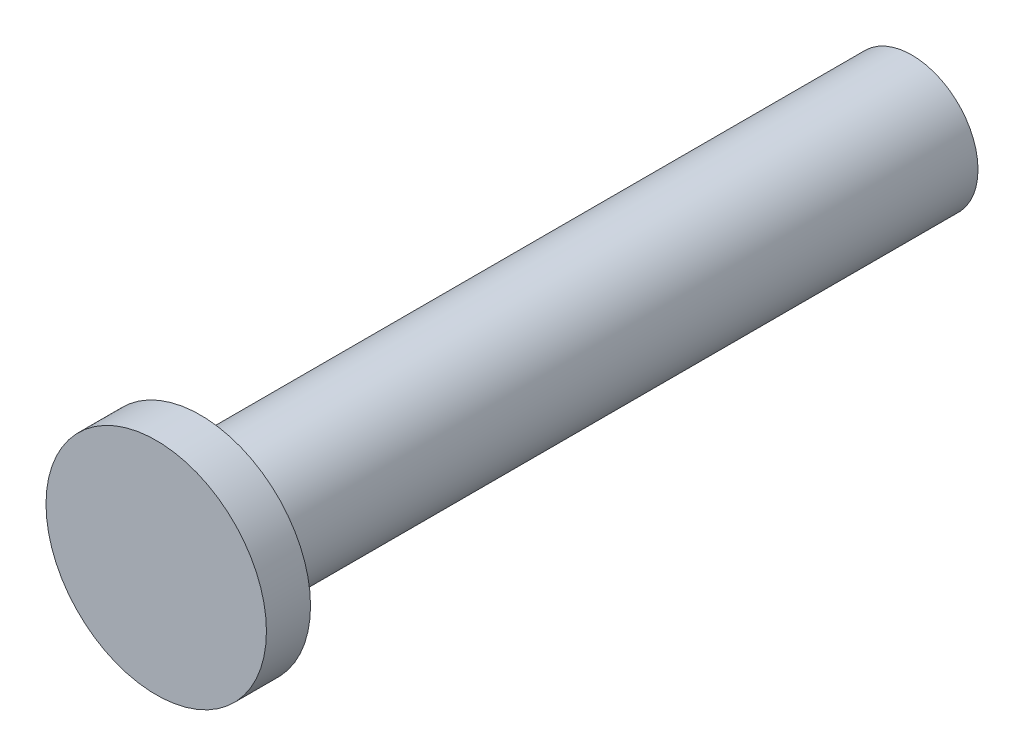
from build123d import *

# Parameters (mm, degrees)
ESQUISSE1_R          = 1.5
BASE_EXTRUSION_DEPTH = 16.14
ESQUISSE2_R          = 2.5
BOSS_EXTRU_1_DEPTH   = 1


with BuildPart() as part:
    # Esquisse1 → Base-Extrusion (new body)
    with BuildSketch(Plane.XY):
        Circle(ESQUISSE1_R)
    extrude(amount=BASE_EXTRUSION_DEPTH)

    # Esquisse2 → Boss.-Extru.1 (add)
    with BuildSketch(Plane.XY.offset(16.14)):
        Circle(ESQUISSE2_R)
    extrude(amount=BOSS_EXTRU_1_DEPTH)


solid = part.part
